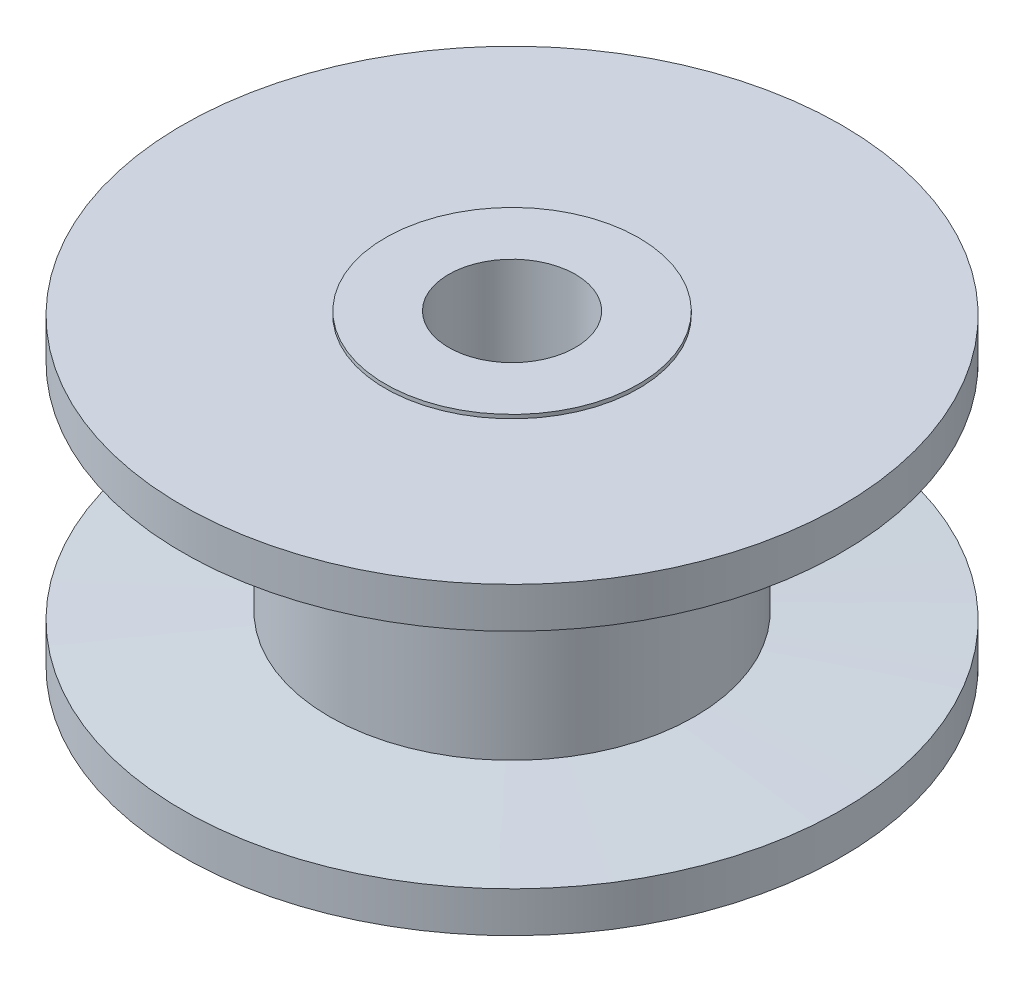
from build123d import *


with BuildPart() as part:
    # Esquisse1 → R_volution1 (revolve)
    with BuildSketch(Plane.XY, mode=Mode.PRIVATE) as r_volution1_sk:
        Polygon((12.5, 0), (12.5, 61.5), (25, 61.5), (25, 60.75), (65, 60.75), (65, 52.75), (36, 51.3), (36, 10.19), (65, 8.75), (65, 0.75), (25, 0.75), (25, 0), align=None)
    revolve(r_volution1_sk.sketch.rotate(Axis((0, 0, 0), (0, 1, 0)), 90), axis=Axis((0, 0, 0), (0, 1, 0)))


solid = part.part
